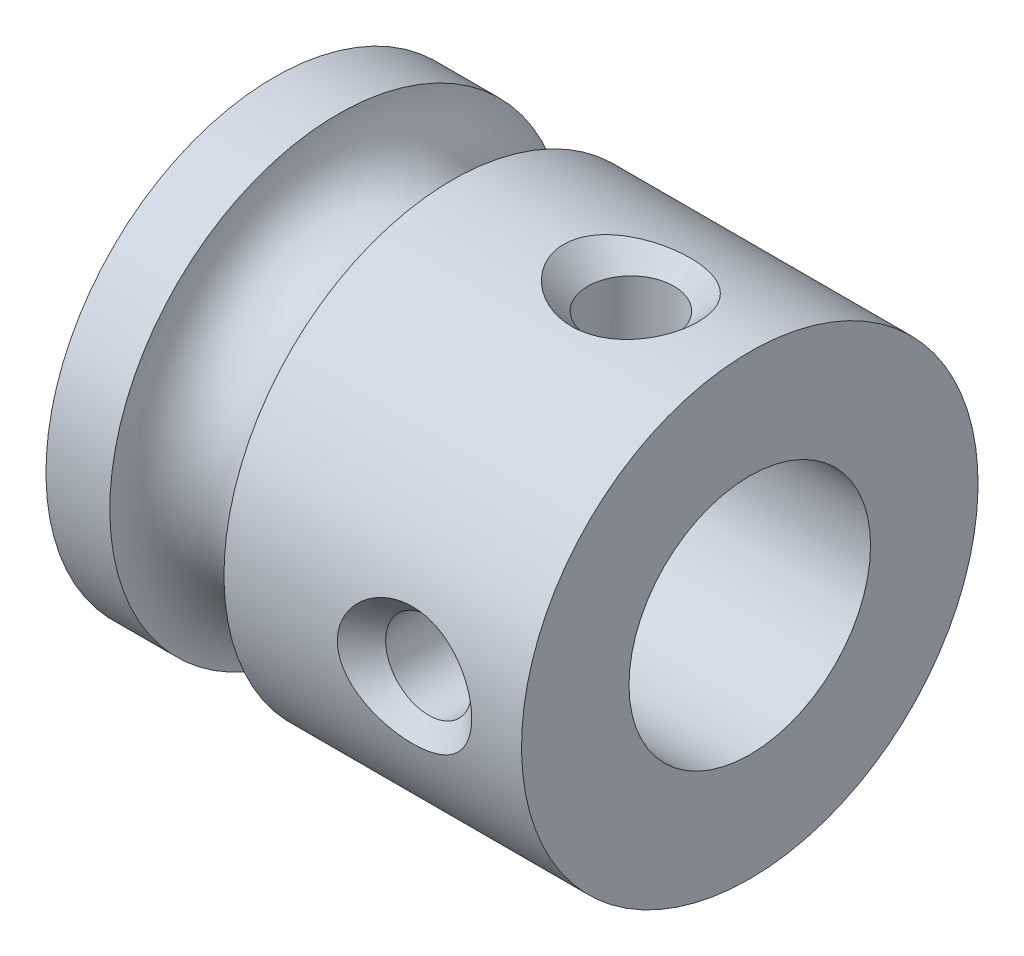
ISO-10303-21;
HEADER;
FILE_DESCRIPTION(('STEP AP214'),'2;1');
FILE_NAME('part.step','',(''),(''),'','','');
FILE_SCHEMA(('AUTOMOTIVE_DESIGN { 1 0 10303 214 1 1 1 1 }'));
ENDSEC;
DATA;
#1=APPLICATION_CONTEXT('core data for automotive mechanical design processes');
#2=APPLICATION_PROTOCOL_DEFINITION('international standard','automotive_design',2000,#1);
#3=PRODUCT_CONTEXT('',#1,'mechanical');
#4=PRODUCT('Part','Part','',(#3));
#5=PRODUCT_RELATED_PRODUCT_CATEGORY('part','',(#4));
#6=PRODUCT_DEFINITION_FORMATION('','',#4);
#7=PRODUCT_DEFINITION_CONTEXT('part definition',#1,'design');
#8=PRODUCT_DEFINITION('design','',#6,#7);
#9=PRODUCT_DEFINITION_SHAPE('','',#8);
#10=(LENGTH_UNIT() NAMED_UNIT(*) SI_UNIT(.MILLI.,.METRE.));
#11=(NAMED_UNIT(*) PLANE_ANGLE_UNIT() SI_UNIT($,.RADIAN.));
#12=(NAMED_UNIT(*) SI_UNIT($,.STERADIAN.) SOLID_ANGLE_UNIT());
#13=UNCERTAINTY_MEASURE_WITH_UNIT(LENGTH_MEASURE(1.E-05),#10,'distance_accuracy_value','');
#14=(GEOMETRIC_REPRESENTATION_CONTEXT(3) GLOBAL_UNCERTAINTY_ASSIGNED_CONTEXT((#13)) GLOBAL_UNIT_ASSIGNED_CONTEXT((#10,
#11,#12)) REPRESENTATION_CONTEXT('',''));
#15=CARTESIAN_POINT('',(0.,0.,0.));
#16=DIRECTION('',(0.,0.,1.));
#17=DIRECTION('',(1.,0.,0.));
#18=AXIS2_PLACEMENT_3D('',#15,#16,#17);
#19=CARTESIAN_POINT('',(-6.25,6.,0.));
#20=DIRECTION('',(1.,0.,0.));
#21=DIRECTION('',(0.,1.,0.));
#22=AXIS2_PLACEMENT_3D('',#19,#20,#21);
#23=PLANE('',#22);
#24=CARTESIAN_POINT('',(-6.25,0.,0.));
#25=DIRECTION('',(1.,0.,0.));
#26=DIRECTION('',(0.,0.,-1.));
#27=AXIS2_PLACEMENT_3D('',#24,#25,#26);
#28=CIRCLE('',#27,3.175);
#29=CARTESIAN_POINT('',(-6.25,0.,-3.175));
#30=VERTEX_POINT('',#29);
#31=EDGE_CURVE('E105',#30,#30,#28,.T.);
#32=ORIENTED_EDGE('',*,*,#31,.T.);
#33=EDGE_LOOP('',(#32));
#34=FACE_BOUND('',#33,.T.);
#35=CARTESIAN_POINT('',(-6.25,0.,0.));
#36=DIRECTION('',(-1.,0.,0.));
#37=DIRECTION('',(0.,-1.,0.));
#38=AXIS2_PLACEMENT_3D('',#35,#36,#37);
#39=CIRCLE('',#38,5.99999999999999);
#40=CARTESIAN_POINT('',(-6.25,-5.99999999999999,0.));
#41=VERTEX_POINT('',#40);
#42=EDGE_CURVE('E108',#41,#41,#39,.T.);
#43=ORIENTED_EDGE('',*,*,#42,.T.);
#44=EDGE_LOOP('',(#43));
#45=FACE_BOUND('',#44,.T.);
#46=ADVANCED_FACE('F35',(#34,#45),#23,.F.);
#47=CARTESIAN_POINT('',(6.25,6.,0.));
#48=DIRECTION('',(-1.,0.,0.));
#49=DIRECTION('',(0.,-1.,0.));
#50=AXIS2_PLACEMENT_3D('',#47,#48,#49);
#51=PLANE('',#50);
#52=CARTESIAN_POINT('',(6.25,0.,0.));
#53=DIRECTION('',(1.,0.,0.));
#54=DIRECTION('',(0.,0.,-1.));
#55=AXIS2_PLACEMENT_3D('',#52,#53,#54);
#56=CIRCLE('',#55,3.175);
#57=CARTESIAN_POINT('',(6.25,0.,-3.175));
#58=VERTEX_POINT('',#57);
#59=EDGE_CURVE('E113',#58,#58,#56,.T.);
#60=ORIENTED_EDGE('',*,*,#59,.F.);
#61=EDGE_LOOP('',(#60));
#62=FACE_BOUND('',#61,.T.);
#63=CARTESIAN_POINT('',(6.25,0.,0.));
#64=DIRECTION('',(-1.,0.,0.));
#65=DIRECTION('',(0.,-1.,0.));
#66=AXIS2_PLACEMENT_3D('',#63,#64,#65);
#67=CIRCLE('',#66,5.99999999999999);
#68=CARTESIAN_POINT('',(6.25,-5.99999999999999,0.));
#69=VERTEX_POINT('',#68);
#70=EDGE_CURVE('E49',#69,#69,#67,.T.);
#71=ORIENTED_EDGE('',*,*,#70,.F.);
#72=EDGE_LOOP('',(#71));
#73=FACE_BOUND('',#72,.T.);
#74=ADVANCED_FACE('F93',(#62,#73),#51,.F.);
#75=CARTESIAN_POINT('',(-27.9821883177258,0.,0.));
#76=DIRECTION('',(-1.,0.,0.));
#77=DIRECTION('',(0.,-1.,0.));
#78=AXIS2_PLACEMENT_3D('',#75,#76,#77);
#79=CYLINDRICAL_SURFACE('',#78,5.99999999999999);
#80=CARTESIAN_POINT('',(1.98582900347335,-1.1497584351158,5.88880765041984));
#81=CARTESIAN_POINT('',(1.92256396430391,-1.09867562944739,5.89878047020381));
#82=CARTESIAN_POINT('',(1.86295150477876,-1.0431284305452,5.90893808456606));
#83=CARTESIAN_POINT('',(1.75259962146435,-0.923689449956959,5.92878244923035));
#84=CARTESIAN_POINT('',(1.70186117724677,-0.859796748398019,5.93846914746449));
#85=CARTESIAN_POINT('',(1.60475637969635,-0.715263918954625,5.95771798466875));
#86=CARTESIAN_POINT('',(1.55995563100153,-0.63352922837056,5.9670790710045));
#87=CARTESIAN_POINT('',(1.48677574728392,-0.462716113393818,5.98274294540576));
#88=CARTESIAN_POINT('',(1.45838486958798,-0.373642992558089,5.98904791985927));
#89=CARTESIAN_POINT('',(1.42244978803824,-0.202993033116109,5.99709496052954));
#90=CARTESIAN_POINT('',(1.41271975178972,-0.121896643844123,5.99931400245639));
#91=CARTESIAN_POINT('',(1.40788784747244,0.0407329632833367,6.00041151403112));
#92=CARTESIAN_POINT('',(1.41277817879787,0.122265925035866,5.99929176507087));
#93=CARTESIAN_POINT('',(1.43593853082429,0.27691734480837,5.99406837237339));
#94=CARTESIAN_POINT('',(1.45316296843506,0.350204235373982,5.99019807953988));
#95=CARTESIAN_POINT('',(1.49894636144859,0.492961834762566,5.98014322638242));
#96=CARTESIAN_POINT('',(1.52750675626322,0.562432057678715,5.97395837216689));
#97=CARTESIAN_POINT('',(1.59615155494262,0.698882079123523,5.959569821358));
#98=CARTESIAN_POINT('',(1.63666976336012,0.765634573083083,5.95129221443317));
#99=CARTESIAN_POINT('',(1.72713995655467,0.892224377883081,5.93363537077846));
#100=CARTESIAN_POINT('',(1.77709576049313,0.952058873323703,5.92425568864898));
#101=CARTESIAN_POINT('',(1.89135797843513,1.07069918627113,5.90403651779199));
#102=CARTESIAN_POINT('',(1.95666495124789,1.12853365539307,5.89315621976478));
#103=CARTESIAN_POINT('',(2.0952376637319,1.23384485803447,5.87201134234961));
#104=CARTESIAN_POINT('',(2.16850745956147,1.28131627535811,5.86174708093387));
#105=CARTESIAN_POINT('',(2.33069428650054,1.37062173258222,5.841553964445));
#106=CARTESIAN_POINT('',(2.4204250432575,1.41102726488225,5.83182444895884));
#107=CARTESIAN_POINT('',(2.60527456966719,1.47761118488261,5.81531116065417));
#108=CARTESIAN_POINT('',(2.70039510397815,1.50378488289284,5.80852835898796));
#109=CARTESIAN_POINT('',(2.90049340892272,1.54287980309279,5.79827299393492));
#110=CARTESIAN_POINT('',(3.00569393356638,1.55473946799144,5.79506680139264));
#111=CARTESIAN_POINT('',(3.21668421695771,1.56155017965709,5.79323500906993));
#112=CARTESIAN_POINT('',(3.32247405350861,1.55649893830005,5.79461002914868));
#113=CARTESIAN_POINT('',(3.53353764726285,1.52933750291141,5.80183828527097));
#114=CARTESIAN_POINT('',(3.63877167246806,1.50693718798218,5.80776766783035));
#115=CARTESIAN_POINT('',(3.8438356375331,1.44507823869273,5.82346635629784));
#116=CARTESIAN_POINT('',(3.94366453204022,1.40561631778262,5.83323640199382));
#117=CARTESIAN_POINT('',(4.13397781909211,1.31064901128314,5.85530084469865));
#118=CARTESIAN_POINT('',(4.22453769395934,1.25529003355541,5.86757192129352));
#119=CARTESIAN_POINT('',(4.39415074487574,1.12919274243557,5.89313562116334));
#120=CARTESIAN_POINT('',(4.47320565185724,1.0584567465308,5.90642809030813));
#121=CARTESIAN_POINT('',(4.61175384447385,0.907818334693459,5.93138370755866));
#122=CARTESIAN_POINT('',(4.67216546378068,0.828773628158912,5.94309674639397));
#123=CARTESIAN_POINT('',(4.7765263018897,0.660195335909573,5.96416874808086));
#124=CARTESIAN_POINT('',(4.82049800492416,0.57067629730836,5.97353092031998));
#125=CARTESIAN_POINT('',(4.88438443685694,0.396718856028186,5.98741815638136));
#126=CARTESIAN_POINT('',(4.90673817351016,0.313214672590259,5.99242422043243));
#127=CARTESIAN_POINT('',(4.93544905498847,0.143381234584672,5.9988859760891));
#128=CARTESIAN_POINT('',(4.94182008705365,0.057054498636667,6.00034474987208));
#129=CARTESIAN_POINT('',(4.93836942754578,-0.105352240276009,5.99956185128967));
#130=CARTESIAN_POINT('',(4.93031154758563,-0.181478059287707,5.99772321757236));
#131=CARTESIAN_POINT('',(4.9017862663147,-0.33123434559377,5.9913186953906));
#132=CARTESIAN_POINT('',(4.88131920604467,-0.404864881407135,5.98675288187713));
#133=CARTESIAN_POINT('',(4.82903124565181,-0.547637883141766,5.97538482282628));
#134=CARTESIAN_POINT('',(4.79722606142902,-0.616786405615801,5.96858567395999));
#135=CARTESIAN_POINT('',(4.7235976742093,-0.749314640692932,5.95340107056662));
#136=CARTESIAN_POINT('',(4.68177142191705,-0.81269258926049,5.94501513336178));
#137=CARTESIAN_POINT('',(4.58498364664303,-0.938599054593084,5.92650599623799));
#138=CARTESIAN_POINT('',(4.52913471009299,-1.00043063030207,5.91629304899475));
#139=CARTESIAN_POINT('',(4.40888796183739,-1.1150961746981,5.89575784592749));
#140=CARTESIAN_POINT('',(4.34448581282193,-1.16792554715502,5.8854355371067));
#141=CARTESIAN_POINT('',(4.19992005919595,-1.27030383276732,5.86424872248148));
#142=CARTESIAN_POINT('',(4.11879660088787,-1.31852122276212,5.85348972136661));
#143=CARTESIAN_POINT('',(3.94997245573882,-1.40215417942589,5.83402179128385));
#144=CARTESIAN_POINT('',(3.86226900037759,-1.43756432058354,5.82531373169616));
#145=CARTESIAN_POINT('',(3.67390722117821,-1.49787467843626,5.81011525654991));
#146=CARTESIAN_POINT('',(3.57280642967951,-1.52147241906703,5.80391061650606));
#147=CARTESIAN_POINT('',(3.36798630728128,-1.5524746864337,5.79569494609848));
#148=CARTESIAN_POINT('',(3.26426655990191,-1.5598766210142,5.79368458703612));
#149=CARTESIAN_POINT('',(3.05352667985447,-1.558341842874,5.7940983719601));
#150=CARTESIAN_POINT('',(2.94651032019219,-1.54885915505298,5.79667070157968));
#151=CARTESIAN_POINT('',(2.73560331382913,-1.51263425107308,5.80622799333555));
#152=CARTESIAN_POINT('',(2.63171362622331,-1.48588679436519,5.81321429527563));
#153=CARTESIAN_POINT('',(2.43216802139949,-1.41627594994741,5.83055881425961));
#154=CARTESIAN_POINT('',(2.33638744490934,-1.37375213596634,5.84084540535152));
#155=CARTESIAN_POINT('',(2.15369382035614,-1.27316382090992,5.86359118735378));
#156=CARTESIAN_POINT('',(2.06677190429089,-1.2151150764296,5.87604817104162));
#157=CARTESIAN_POINT('',(1.98582900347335,-1.1497584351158,5.88880765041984));
#158=B_SPLINE_CURVE_WITH_KNOTS('',3,(#80,#81,#82,#83,#84,#85,#86,#87,#88,#89,#90,#91,#92,#93,
#94,#95,#96,#97,#98,#99,#100,#101,#102,#103,#104,#105,#106,#107,#108,#109,#110,#111,#112,#113,
#114,#115,#116,#117,#118,#119,#120,#121,#122,#123,#124,#125,#126,#127,#128,#129,#130,#131,#132,
#133,#134,#135,#136,#137,#138,#139,#140,#141,#142,#143,#144,#145,#146,#147,#148,#149,#150,#151,
#152,#153,#154,#155,#156,#157),.UNSPECIFIED.,.T.,.F.,(4,2,2,2,2,2,2,2,2,2,2,2,2,2,2,2,2,2,2,2,2,
2,2,2,2,2,2,2,2,2,2,2,2,2,2,2,2,2,4),(0.,0.245511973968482,0.49105103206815,0.7704209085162,
1.04959062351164,1.29338310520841,1.53704553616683,1.76218133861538,1.98734573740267,
2.22197140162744,2.45669221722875,2.71936969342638,2.98218160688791,3.27757543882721,
3.57306655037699,3.8893403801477,4.20565700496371,4.52738058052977,4.84916615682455,
5.16807832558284,5.48694246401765,5.78572744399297,6.08410227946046,6.34237487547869,
6.60042298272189,6.82904241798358,7.05765557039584,7.28595306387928,7.51432011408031,
7.76515327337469,8.01611411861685,8.29988009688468,8.58376614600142,8.89436491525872,
9.2050133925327,9.52588998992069,9.84686403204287,10.1612962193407,10.475410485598),.UNSPECIFIED.);
#159=CARTESIAN_POINT('',(1.98582900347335,-1.1497584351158,5.88880765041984));
#160=VERTEX_POINT('',#159);
#161=EDGE_CURVE('E10',#160,#160,#158,.T.);
#162=ORIENTED_EDGE('',*,*,#161,.T.);
#163=EDGE_LOOP('',(#162));
#164=FACE_BOUND('',#163,.T.);
#165=CARTESIAN_POINT('',(1.93582900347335,5.88880765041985,-1.1497584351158));
#166=CARTESIAN_POINT('',(2.01449710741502,5.87640691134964,-1.21327658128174));
#167=CARTESIAN_POINT('',(2.09885933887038,5.86428443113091,-1.2699258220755));
#168=CARTESIAN_POINT('',(2.27608287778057,5.84204435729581,-1.36860906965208));
#169=CARTESIAN_POINT('',(2.3689596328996,5.83193051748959,-1.41061582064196));
#170=CARTESIAN_POINT('',(2.56089156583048,5.81483480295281,-1.47951525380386));
#171=CARTESIAN_POINT('',(2.65997176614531,5.80786668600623,-1.50634167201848));
#172=CARTESIAN_POINT('',(2.86124327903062,5.79791733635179,-1.54419553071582));
#173=CARTESIAN_POINT('',(2.96343328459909,5.79493445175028,-1.55522951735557));
#174=CARTESIAN_POINT('',(3.17275700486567,5.7932533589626,-1.56148410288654));
#175=CARTESIAN_POINT('',(3.27991397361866,5.79474535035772,-1.556002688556));
#176=CARTESIAN_POINT('',(3.49179652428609,5.80225095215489,-1.52777369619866));
#177=CARTESIAN_POINT('',(3.59652141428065,5.80826583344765,-1.50502126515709));
#178=CARTESIAN_POINT('',(3.80081055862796,5.82410279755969,-1.44252008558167));
#179=CARTESIAN_POINT('',(3.90035929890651,5.83393565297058,-1.402723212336));
#180=CARTESIAN_POINT('',(4.09093801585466,5.85619016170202,-1.30669710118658));
#181=CARTESIAN_POINT('',(4.18196678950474,5.86861217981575,-1.25046554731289));
#182=CARTESIAN_POINT('',(4.34966892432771,5.89405194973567,-1.12434747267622));
#183=CARTESIAN_POINT('',(4.42669091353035,5.90704066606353,-1.0549210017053));
#184=CARTESIAN_POINT('',(4.56628250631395,5.9322150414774,-0.902634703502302));
#185=CARTESIAN_POINT('',(4.62886385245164,5.94440134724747,-0.819785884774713));
#186=CARTESIAN_POINT('',(4.73039719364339,5.96500092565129,-0.652024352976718));
#187=CARTESIAN_POINT('',(4.77113297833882,5.97367516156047,-0.568228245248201));
#188=CARTESIAN_POINT('',(4.83560276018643,5.98767698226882,-0.394089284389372));
#189=CARTESIAN_POINT('',(4.85935987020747,5.99300911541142,-0.303755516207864));
#190=CARTESIAN_POINT('',(4.88615692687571,5.99905072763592,-0.1328904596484));
#191=CARTESIAN_POINT('',(4.89162849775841,6.00030216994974,-0.0527539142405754));
#192=CARTESIAN_POINT('',(4.88842792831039,5.99957426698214,0.107210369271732));
#193=CARTESIAN_POINT('',(4.87976044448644,5.99759598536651,0.187038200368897));
#194=CARTESIAN_POINT('',(4.84976821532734,5.99086921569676,0.339006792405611));
#195=CARTESIAN_POINT('',(4.82925391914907,5.98629841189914,0.411318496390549));
#196=CARTESIAN_POINT('',(4.77723199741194,5.97499946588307,0.551673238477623));
#197=CARTESIAN_POINT('',(4.74572267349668,5.96827099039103,0.619715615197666));
#198=CARTESIAN_POINT('',(4.6709287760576,5.95285567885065,0.753875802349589));
#199=CARTESIAN_POINT('',(4.62707837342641,5.94407951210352,0.81966636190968));
#200=CARTESIAN_POINT('',(4.53014328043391,5.92562440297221,0.943889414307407));
#201=CARTESIAN_POINT('',(4.47705454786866,5.91594506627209,1.00231866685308));
#202=CARTESIAN_POINT('',(4.35610496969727,5.89527457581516,1.11785555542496));
#203=CARTESIAN_POINT('',(4.28722828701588,5.88426985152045,1.1738970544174));
#204=CARTESIAN_POINT('',(4.14177131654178,5.86317502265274,1.27509027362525));
#205=CARTESIAN_POINT('',(4.0651871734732,5.85308538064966,1.32023650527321));
#206=CARTESIAN_POINT('',(3.89668085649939,5.83362914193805,1.40386500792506));
#207=CARTESIAN_POINT('',(3.804018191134,5.82449171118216,1.44091359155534));
#208=CARTESIAN_POINT('',(3.61383750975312,5.80948253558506,1.50028399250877));
#209=CARTESIAN_POINT('',(3.51631808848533,5.80361174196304,1.52260152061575));
#210=CARTESIAN_POINT('',(3.31279412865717,5.79552878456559,1.55310020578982));
#211=CARTESIAN_POINT('',(3.20663594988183,5.79356301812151,1.56033069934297));
#212=CARTESIAN_POINT('',(2.99453981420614,5.7942660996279,1.55771618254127));
#213=CARTESIAN_POINT('',(2.8886018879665,5.79693555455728,1.54786893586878));
#214=CARTESIAN_POINT('',(2.67857429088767,5.80664761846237,1.51102915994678));
#215=CARTESIAN_POINT('',(2.57452435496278,5.81374455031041,1.4838235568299));
#216=CARTESIAN_POINT('',(2.3726748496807,5.83148585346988,1.41248596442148));
#217=CARTESIAN_POINT('',(2.27487653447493,5.84213093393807,1.36835059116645));
#218=CARTESIAN_POINT('',(2.08990643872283,5.86547592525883,1.26450761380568));
#219=CARTESIAN_POINT('',(2.00260967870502,5.87814634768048,1.20501690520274));
#220=CARTESIAN_POINT('',(1.84036502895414,5.90401688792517,1.07108271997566));
#221=CARTESIAN_POINT('',(1.76541337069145,5.91721684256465,0.99664382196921));
#222=CARTESIAN_POINT('',(1.63643045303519,5.94134715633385,0.840336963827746));
#223=CARTESIAN_POINT('',(1.58126009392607,5.95237322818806,0.759429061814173));
#224=CARTESIAN_POINT('',(1.48770758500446,5.97172201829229,0.588143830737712));
#225=CARTESIAN_POINT('',(1.44930140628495,5.98004860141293,0.497780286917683));
#226=CARTESIAN_POINT('',(1.39595189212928,5.99179936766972,0.323817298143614));
#227=CARTESIAN_POINT('',(1.3784890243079,5.99574415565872,0.241023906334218));
#228=CARTESIAN_POINT('',(1.35909484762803,6.00013162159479,0.0735621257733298));
#229=CARTESIAN_POINT('',(1.35715207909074,6.00057688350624,-0.0111048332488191));
#230=CARTESIAN_POINT('',(1.3682962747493,5.99804910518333,-0.170672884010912));
#231=CARTESIAN_POINT('',(1.37987317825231,5.99541947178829,-0.245690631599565));
#232=CARTESIAN_POINT('',(1.41500731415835,5.98758623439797,-0.392724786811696));
#233=CARTESIAN_POINT('',(1.43856702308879,5.9823820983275,-0.464740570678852));
#234=CARTESIAN_POINT('',(1.49701267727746,5.96983089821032,-0.605122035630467));
#235=CARTESIAN_POINT('',(1.532071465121,5.96245131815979,-0.673412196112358));
#236=CARTESIAN_POINT('',(1.61196643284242,5.9462838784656,-0.80375604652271));
#237=CARTESIAN_POINT('',(1.65679828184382,5.93749664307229,-0.865812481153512));
#238=CARTESIAN_POINT('',(1.74030838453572,5.92194720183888,-0.965551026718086));
#239=CARTESIAN_POINT('',(1.77690804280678,5.91535114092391,-1.00502767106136));
#240=CARTESIAN_POINT('',(1.85374434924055,5.90207969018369,-1.08023695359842));
#241=CARTESIAN_POINT('',(1.8939810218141,5.89540429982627,-1.11596956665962));
#242=CARTESIAN_POINT('',(1.93582900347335,5.88880765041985,-1.1497584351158));
#243=B_SPLINE_CURVE_WITH_KNOTS('',3,(#165,#166,#167,#168,#169,#170,#171,#172,#173,#174,#175,
#176,#177,#178,#179,#180,#181,#182,#183,#184,#185,#186,#187,#188,#189,#190,#191,#192,#193,#194,
#195,#196,#197,#198,#199,#200,#201,#202,#203,#204,#205,#206,#207,#208,#209,#210,#211,#212,#213,
#214,#215,#216,#217,#218,#219,#220,#221,#222,#223,#224,#225,#226,#227,#228,#229,#230,#231,#232,
#233,#234,#235,#236,#237,#238,#239,#240,#241,#242),.UNSPECIFIED.,.T.,.F.,(4,2,2,2,2,2,2,2,2,2,2,
2,2,2,2,2,2,2,2,2,2,2,2,2,2,2,2,2,2,2,2,2,2,2,2,2,2,2,4),(0.,0.305401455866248,
0.611368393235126,0.918660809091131,1.22582581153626,1.54622888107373,1.86672201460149,
2.188126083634,2.50957546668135,2.82138528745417,3.13294065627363,3.4119996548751,
3.69067804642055,3.93040363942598,4.17005029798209,4.39497187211,4.61992820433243,
4.85762506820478,5.09542619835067,5.36277249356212,5.63025318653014,5.92958497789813,
6.22900388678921,6.54678146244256,6.86460065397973,7.18639816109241,7.50826002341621,
7.82580312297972,8.14324910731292,8.43715799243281,8.73064420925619,8.98333026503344,
9.23582972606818,9.46262185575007,9.68946087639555,9.91987901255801,10.1501952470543,
10.3126543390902,10.4751145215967),.UNSPECIFIED.);
#244=CARTESIAN_POINT('',(1.93582900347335,5.88880765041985,-1.1497584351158));
#245=VERTEX_POINT('',#244);
#246=EDGE_CURVE('E45',#245,#245,#243,.T.);
#247=ORIENTED_EDGE('',*,*,#246,.T.);
#248=EDGE_LOOP('',(#247));
#249=FACE_BOUND('',#248,.T.);
#250=CARTESIAN_POINT('',(-1.57146093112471,0.,0.));
#251=DIRECTION('',(-1.,0.,0.));
#252=DIRECTION('',(0.,-1.,0.));
#253=AXIS2_PLACEMENT_3D('',#250,#251,#252);
#254=CIRCLE('',#253,5.99999999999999);
#255=CARTESIAN_POINT('',(-1.5714609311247,-5.99999999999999,0.));
#256=VERTEX_POINT('',#255);
#257=EDGE_CURVE('E54',#256,#256,#254,.T.);
#258=ORIENTED_EDGE('',*,*,#257,.F.);
#259=EDGE_LOOP('',(#258));
#260=FACE_BOUND('',#259,.T.);
#261=ORIENTED_EDGE('',*,*,#70,.T.);
#262=EDGE_LOOP('',(#261));
#263=FACE_BOUND('',#262,.T.);
#264=ADVANCED_FACE('F69',(#164,#249,#260,#263),#79,.T.);
#265=CARTESIAN_POINT('',(-3.0714609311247,0.,0.));
#266=DIRECTION('',(-1.,0.,0.));
#267=DIRECTION('',(0.,-1.,0.));
#268=AXIS2_PLACEMENT_3D('',#265,#266,#267);
#269=TOROIDAL_SURFACE('',#268,5.99999999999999,1.5);
#270=CARTESIAN_POINT('',(-4.5714609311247,0.,0.));
#271=DIRECTION('',(-1.,0.,0.));
#272=DIRECTION('',(0.,-1.,0.));
#273=AXIS2_PLACEMENT_3D('',#270,#271,#272);
#274=CIRCLE('',#273,5.99999999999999);
#275=CARTESIAN_POINT('',(-4.5714609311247,-5.99999999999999,0.));
#276=VERTEX_POINT('',#275);
#277=EDGE_CURVE('E109',#276,#276,#274,.T.);
#278=ORIENTED_EDGE('',*,*,#277,.F.);
#279=EDGE_LOOP('',(#278));
#280=FACE_BOUND('',#279,.T.);
#281=ORIENTED_EDGE('',*,*,#257,.T.);
#282=EDGE_LOOP('',(#281));
#283=FACE_BOUND('',#282,.T.);
#284=ADVANCED_FACE('F86',(#280,#283),#269,.F.);
#285=CARTESIAN_POINT('',(-27.9821883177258,0.,0.));
#286=DIRECTION('',(-1.,0.,0.));
#287=DIRECTION('',(0.,-1.,0.));
#288=AXIS2_PLACEMENT_3D('',#285,#286,#287);
#289=CYLINDRICAL_SURFACE('',#288,5.99999999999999);
#290=ORIENTED_EDGE('',*,*,#42,.F.);
#291=EDGE_LOOP('',(#290));
#292=FACE_BOUND('',#291,.T.);
#293=ORIENTED_EDGE('',*,*,#277,.T.);
#294=EDGE_LOOP('',(#293));
#295=FACE_BOUND('',#294,.T.);
#296=ADVANCED_FACE('F82',(#292,#295),#289,.T.);
#297=CARTESIAN_POINT('',(6.25,0.,0.));
#298=DIRECTION('',(1.,0.,0.));
#299=DIRECTION('',(0.,0.,-1.));
#300=AXIS2_PLACEMENT_3D('',#297,#298,#299);
#301=CYLINDRICAL_SURFACE('',#300,3.175);
#302=CARTESIAN_POINT('',(2.04470000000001,0.,3.175));
#303=CARTESIAN_POINT('',(2.04469877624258,-0.0614285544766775,3.17500087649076));
#304=CARTESIAN_POINT('',(2.04972367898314,-0.122848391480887,3.17320130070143));
#305=CARTESIAN_POINT('',(2.06961858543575,-0.243864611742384,3.16620100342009));
#306=CARTESIAN_POINT('',(2.08448828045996,-0.303461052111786,3.16100038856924));
#307=CARTESIAN_POINT('',(2.12348844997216,-0.419068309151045,3.14775949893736));
#308=CARTESIAN_POINT('',(2.14760216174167,-0.475085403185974,3.13972436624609));
#309=CARTESIAN_POINT('',(2.20432504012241,-0.582278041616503,3.12162393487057));
#310=CARTESIAN_POINT('',(2.23693622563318,-0.63345243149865,3.11155815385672));
#311=CARTESIAN_POINT('',(2.31105507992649,-0.731495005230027,3.09000790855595));
#312=CARTESIAN_POINT('',(2.35283431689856,-0.778149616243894,3.07848610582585));
#313=CARTESIAN_POINT('',(2.44352654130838,-0.863958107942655,3.055516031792));
#314=CARTESIAN_POINT('',(2.49244140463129,-0.903110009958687,3.04406778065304));
#315=CARTESIAN_POINT('',(2.59802569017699,-0.974093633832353,3.02211785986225));
#316=CARTESIAN_POINT('',(2.65490051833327,-1.00563502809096,3.01166094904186));
#317=CARTESIAN_POINT('',(2.77357939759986,-1.05861134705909,2.99345244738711));
#318=CARTESIAN_POINT('',(2.8353816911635,-1.08004985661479,2.98569989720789));
#319=CARTESIAN_POINT('',(2.9597149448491,-1.11138819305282,2.9741742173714));
#320=CARTESIAN_POINT('',(3.0221306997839,-1.12169236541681,2.97026214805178));
#321=CARTESIAN_POINT('',(3.14791847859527,-1.13173392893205,2.96645158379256));
#322=CARTESIAN_POINT('',(3.21129014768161,-1.13147514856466,2.96655163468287));
#323=CARTESIAN_POINT('',(3.3336133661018,-1.12070953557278,2.97063328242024));
#324=CARTESIAN_POINT('',(3.39262097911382,-1.11074743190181,2.9744085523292));
#325=CARTESIAN_POINT('',(3.50806464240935,-1.08175290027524,2.98507483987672));
#326=CARTESIAN_POINT('',(3.56450034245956,-1.06271924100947,2.99196628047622));
#327=CARTESIAN_POINT('',(3.67436762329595,-1.01579639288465,3.00822311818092));
#328=CARTESIAN_POINT('',(3.72772847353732,-0.987756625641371,3.01763009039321));
#329=CARTESIAN_POINT('',(3.82915226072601,-0.923722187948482,3.03784253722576));
#330=CARTESIAN_POINT('',(3.87721349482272,-0.887724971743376,3.04864845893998));
#331=CARTESIAN_POINT('',(3.96971122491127,-0.806247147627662,3.0712342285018));
#332=CARTESIAN_POINT('',(4.01375635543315,-0.760326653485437,3.08303358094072));
#333=CARTESIAN_POINT('',(4.09363040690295,-0.661610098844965,3.10571393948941));
#334=CARTESIAN_POINT('',(4.12945830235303,-0.608813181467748,3.11659483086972));
#335=CARTESIAN_POINT('',(4.19225643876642,-0.496923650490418,3.13639217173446));
#336=CARTESIAN_POINT('',(4.21910836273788,-0.437759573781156,3.14528190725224));
#337=CARTESIAN_POINT('',(4.2623520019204,-0.315359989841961,3.15989936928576));
#338=CARTESIAN_POINT('',(4.27874788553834,-0.252126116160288,3.16562835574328));
#339=CARTESIAN_POINT('',(4.29988948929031,-0.126684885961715,3.17306329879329));
#340=CARTESIAN_POINT('',(4.3051630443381,-0.0645771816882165,3.17495136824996));
#341=CARTESIAN_POINT('',(4.30543160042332,0.0596565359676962,3.17504672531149));
#342=CARTESIAN_POINT('',(4.30042861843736,0.121782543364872,3.1732547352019));
#343=CARTESIAN_POINT('',(4.28069555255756,0.2420876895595,3.16631168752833));
#344=CARTESIAN_POINT('',(4.26630097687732,0.300329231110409,3.16127656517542));
#345=CARTESIAN_POINT('',(4.22862458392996,0.413538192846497,3.14846933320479));
#346=CARTESIAN_POINT('',(4.20534161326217,0.468505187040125,3.14069686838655));
#347=CARTESIAN_POINT('',(4.14983109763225,0.57533272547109,3.12292068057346));
#348=CARTESIAN_POINT('',(4.11737039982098,0.627062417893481,3.11286035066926));
#349=CARTESIAN_POINT('',(4.04469392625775,0.724505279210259,3.09163517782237));
#350=CARTESIAN_POINT('',(4.00447550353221,0.770216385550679,3.08046995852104));
#351=CARTESIAN_POINT('',(3.91495158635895,0.856811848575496,3.05754963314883));
#352=CARTESIAN_POINT('',(3.86528162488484,0.897320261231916,3.0457941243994));
#353=CARTESIAN_POINT('',(3.75960588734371,0.96948829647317,3.02359841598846));
#354=CARTESIAN_POINT('',(3.70359981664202,1.00114750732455,3.01315827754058));
#355=CARTESIAN_POINT('',(3.58660726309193,1.05465477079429,2.99485112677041));
#356=CARTESIAN_POINT('',(3.52561638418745,1.07649405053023,2.98698641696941));
#357=CARTESIAN_POINT('',(3.40047036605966,1.10946944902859,2.97489781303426));
#358=CARTESIAN_POINT('',(3.33631694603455,1.12061131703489,2.97067196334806));
#359=CARTESIAN_POINT('',(3.21069434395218,1.13139068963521,2.96658222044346));
#360=CARTESIAN_POINT('',(3.14928675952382,1.13166111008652,2.96647835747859));
#361=CARTESIAN_POINT('',(3.02735111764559,1.12228164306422,2.97003931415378));
#362=CARTESIAN_POINT('',(2.96682299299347,1.1126325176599,2.97370384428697));
#363=CARTESIAN_POINT('',(2.84987294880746,1.08416089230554,2.98419839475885));
#364=CARTESIAN_POINT('',(2.79338646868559,1.06557142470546,2.99094779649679));
#365=CARTESIAN_POINT('',(2.68429540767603,1.01994372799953,3.0068123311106));
#366=CARTESIAN_POINT('',(2.63169176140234,0.992903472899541,3.01592803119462));
#367=CARTESIAN_POINT('',(2.52909051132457,0.929616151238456,3.03604854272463));
#368=CARTESIAN_POINT('',(2.4793429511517,0.89298623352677,3.0471235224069));
#369=CARTESIAN_POINT('',(2.38649729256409,0.812177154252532,3.06964995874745));
#370=CARTESIAN_POINT('',(2.34340120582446,0.767995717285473,3.08110152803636));
#371=CARTESIAN_POINT('',(2.26303642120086,0.670861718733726,3.10373428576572));
#372=CARTESIAN_POINT('',(2.22613466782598,0.617595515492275,3.11487776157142));
#373=CARTESIAN_POINT('',(2.16183451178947,0.505234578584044,3.13506244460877));
#374=CARTESIAN_POINT('',(2.13443530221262,0.446140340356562,3.14410383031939));
#375=CARTESIAN_POINT('',(2.09006649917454,0.323645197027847,3.15906443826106));
#376=CARTESIAN_POINT('',(2.07311543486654,0.260236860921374,3.16497811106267));
#377=CARTESIAN_POINT('',(2.05043499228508,0.13121513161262,3.17294468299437));
#378=CARTESIAN_POINT('',(2.04470130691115,0.0656025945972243,3.17499906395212));
#379=CARTESIAN_POINT('',(2.04470000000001,0.,3.175));
#380=B_SPLINE_CURVE_WITH_KNOTS('',3,(#302,#303,#304,#305,#306,#307,#308,#309,#310,#311,#312,
#313,#314,#315,#316,#317,#318,#319,#320,#321,#322,#323,#324,#325,#326,#327,#328,#329,#330,#331,
#332,#333,#334,#335,#336,#337,#338,#339,#340,#341,#342,#343,#344,#345,#346,#347,#348,#349,#350,
#351,#352,#353,#354,#355,#356,#357,#358,#359,#360,#361,#362,#363,#364,#365,#366,#367,#368,#369,
#370,#371,#372,#373,#374,#375,#376,#377,#378,#379),.UNSPECIFIED.,.T.,.F.,(4,2,2,2,2,2,2,2,2,2,2,
2,2,2,2,2,2,2,2,2,2,2,2,2,2,2,2,2,2,2,2,2,2,2,2,2,2,2,4),(0.,0.184043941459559,
0.368082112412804,0.55178812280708,0.735537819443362,0.925722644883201,1.11595755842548,
1.31258758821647,1.50914779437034,1.69830149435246,1.88738663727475,2.0664345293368,
2.24550673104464,2.42774410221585,2.61003985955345,2.80329006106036,2.99656436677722,
3.19229416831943,3.38794589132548,3.57408187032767,3.76018131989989,3.93997181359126,
4.11978564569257,4.30465683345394,4.48959121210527,4.68416822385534,4.87875428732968,
5.07351384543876,5.26816867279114,5.45147357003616,5.63476438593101,5.81351722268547,
5.99231294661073,6.17977826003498,6.36730015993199,6.56359488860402,6.75987294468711,
6.95649809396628,7.15304773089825),.UNSPECIFIED.);
#381=CARTESIAN_POINT('',(2.04470000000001,0.,3.175));
#382=VERTEX_POINT('',#381);
#383=EDGE_CURVE('E65',#382,#382,#380,.T.);
#384=ORIENTED_EDGE('',*,*,#383,.T.);
#385=EDGE_LOOP('',(#384));
#386=FACE_BOUND('',#385,.T.);
#387=CARTESIAN_POINT('',(3.125,2.96699290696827,-1.13029999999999));
#388=CARTESIAN_POINT('',(3.06371104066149,2.96699180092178,-1.1303012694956));
#389=CARTESIAN_POINT('',(3.00243087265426,2.96891266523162,-1.12529831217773));
#390=CARTESIAN_POINT('',(2.8817032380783,2.976341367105,-1.10549852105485));
#391=CARTESIAN_POINT('',(2.82225587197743,2.9818494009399,-1.09070115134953));
#392=CARTESIAN_POINT('',(2.70696624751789,2.9957511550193,-1.05191211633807));
#393=CARTESIAN_POINT('',(2.65111641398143,3.00413855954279,-1.02794056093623));
#394=CARTESIAN_POINT('',(2.54421075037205,3.02284430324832,-0.971553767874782));
#395=CARTESIAN_POINT('',(2.49315619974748,3.03316315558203,-0.939136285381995));
#396=CARTESIAN_POINT('',(2.39500779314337,3.05508626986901,-0.865225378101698));
#397=CARTESIAN_POINT('',(2.34815910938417,3.06672572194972,-0.823416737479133));
#398=CARTESIAN_POINT('',(2.26196785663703,3.08968323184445,-0.732580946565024));
#399=CARTESIAN_POINT('',(2.22262669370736,3.1010012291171,-0.683552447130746));
#400=CARTESIAN_POINT('',(2.15141872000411,3.1224537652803,-0.577839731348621));
#401=CARTESIAN_POINT('',(2.11981389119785,3.13254217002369,-0.520968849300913));
#402=CARTESIAN_POINT('',(2.066719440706,3.14997980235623,-0.402295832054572));
#403=CARTESIAN_POINT('',(2.04522668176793,3.15732987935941,-0.340495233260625));
#404=CARTESIAN_POINT('',(2.01381290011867,3.16821317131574,-0.216291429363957));
#405=CARTESIAN_POINT('',(2.00347077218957,3.17188488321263,-0.154007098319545));
#406=CARTESIAN_POINT('',(1.99330739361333,3.17549223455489,-0.0284859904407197));
#407=CARTESIAN_POINT('',(1.99348305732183,3.17542896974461,0.034750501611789));
#408=CARTESIAN_POINT('',(2.00409474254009,3.17166431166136,0.157380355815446));
#409=CARTESIAN_POINT('',(2.01407222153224,3.16812551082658,0.216819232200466));
#410=CARTESIAN_POINT('',(2.04323912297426,3.1580163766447,0.333116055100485));
#411=CARTESIAN_POINT('',(2.06242918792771,3.15144583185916,0.389973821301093));
#412=CARTESIAN_POINT('',(2.10971458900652,3.13581701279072,0.500434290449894));
#413=CARTESIAN_POINT('',(2.13793071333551,3.12672523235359,0.55398035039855));
#414=CARTESIAN_POINT('',(2.20236408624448,3.10698647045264,0.655704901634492));
#415=CARTESIAN_POINT('',(2.23858376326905,3.09633901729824,0.70388175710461));
#416=CARTESIAN_POINT('',(2.3202538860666,3.07392952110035,0.796215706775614));
#417=CARTESIAN_POINT('',(2.36609295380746,3.06213831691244,0.840022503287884));
#418=CARTESIAN_POINT('',(2.46455262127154,3.03923485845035,0.919450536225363));
#419=CARTESIAN_POINT('',(2.51717459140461,3.02812274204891,0.95507011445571));
#420=CARTESIAN_POINT('',(2.62895927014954,3.00766281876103,1.01769271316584));
#421=CARTESIAN_POINT('',(2.68822387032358,2.99835093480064,1.04452651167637));
#422=CARTESIAN_POINT('',(2.81084794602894,2.98296002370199,1.08770687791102));
#423=CARTESIAN_POINT('',(2.87420539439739,2.97687940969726,1.10405859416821));
#424=CARTESIAN_POINT('',(2.99978496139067,2.96900658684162,1.12505332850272));
#425=CARTESIAN_POINT('',(3.06190238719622,2.96701300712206,1.13024679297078));
#426=CARTESIAN_POINT('',(3.1861397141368,2.96697312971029,1.13035235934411));
#427=CARTESIAN_POINT('',(3.24825961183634,2.9689259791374,1.12526668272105));
#428=CARTESIAN_POINT('',(3.36806963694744,2.97635611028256,1.10545550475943));
#429=CARTESIAN_POINT('',(3.42583689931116,2.98168526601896,1.0911347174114));
#430=CARTESIAN_POINT('',(3.53812956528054,2.99509779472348,1.05375787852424));
#431=CARTESIAN_POINT('',(3.59265434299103,3.00318169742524,1.03070014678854));
#432=CARTESIAN_POINT('',(3.69902870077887,3.0215413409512,0.975593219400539));
#433=CARTESIAN_POINT('',(3.75071831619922,3.03188377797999,0.943258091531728));
#434=CARTESIAN_POINT('',(3.84813515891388,3.0534751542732,0.870827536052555));
#435=CARTESIAN_POINT('',(3.89386038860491,3.0647243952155,0.83072951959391));
#436=CARTESIAN_POINT('',(3.98070682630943,3.0876248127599,0.741245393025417));
#437=CARTESIAN_POINT('',(4.02142589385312,3.09926313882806,0.691464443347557));
#438=CARTESIAN_POINT('',(4.09397025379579,3.12101743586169,0.585488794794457));
#439=CARTESIAN_POINT('',(4.12579570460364,3.13113343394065,0.529294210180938));
#440=CARTESIAN_POINT('',(4.17939303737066,3.14867455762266,0.412253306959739));
#441=CARTESIAN_POINT('',(4.20121652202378,3.15611345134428,0.351432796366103));
#442=CARTESIAN_POINT('',(4.23421657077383,3.16751726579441,0.226662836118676));
#443=CARTESIAN_POINT('',(4.24539758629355,3.17148363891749,0.162714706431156));
#444=CARTESIAN_POINT('',(4.25635162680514,3.17537085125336,0.037158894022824));
#445=CARTESIAN_POINT('',(4.25669853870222,3.17549520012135,-0.0243929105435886));
#446=CARTESIAN_POINT('',(4.24742232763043,3.1722011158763,-0.146637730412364));
#447=CARTESIAN_POINT('',(4.23780021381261,3.16878304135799,-0.207330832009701));
#448=CARTESIAN_POINT('',(4.20925332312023,3.1588730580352,-0.324899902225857));
#449=CARTESIAN_POINT('',(4.19052049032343,3.15244466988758,-0.381828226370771));
#450=CARTESIAN_POINT('',(4.14446825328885,3.13717898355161,-0.491747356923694));
#451=CARTESIAN_POINT('',(4.11714724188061,3.12834123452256,-0.54473742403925));
#452=CARTESIAN_POINT('',(4.05344643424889,3.10871467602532,-0.647587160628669));
#453=CARTESIAN_POINT('',(4.01674861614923,3.09786207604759,-0.697237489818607));
#454=CARTESIAN_POINT('',(3.93585525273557,3.07555250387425,-0.789857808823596));
#455=CARTESIAN_POINT('',(3.89165715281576,3.06409532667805,-0.832825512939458));
#456=CARTESIAN_POINT('',(3.79457728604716,3.04122635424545,-0.912898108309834));
#457=CARTESIAN_POINT('',(3.74138813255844,3.0298412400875,-0.949639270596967));
#458=CARTESIAN_POINT('',(3.62922984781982,3.00903053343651,-1.01365584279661));
#459=CARTESIAN_POINT('',(3.57026116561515,2.99960478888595,-1.04093198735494));
#460=CARTESIAN_POINT('',(3.44802364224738,2.9839099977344,-1.08510912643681));
#461=CARTESIAN_POINT('',(3.38474775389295,2.97764627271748,-1.10199264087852));
#462=CARTESIAN_POINT('',(3.25597715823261,2.96918932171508,-1.12458464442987));
#463=CARTESIAN_POINT('',(3.19048356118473,2.96699408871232,-1.13029864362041));
#464=CARTESIAN_POINT('',(3.125,2.96699290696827,-1.13029999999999));
#465=B_SPLINE_CURVE_WITH_KNOTS('',3,(#387,#388,#389,#390,#391,#392,#393,#394,#395,#396,#397,
#398,#399,#400,#401,#402,#403,#404,#405,#406,#407,#408,#409,#410,#411,#412,#413,#414,#415,#416,
#417,#418,#419,#420,#421,#422,#423,#424,#425,#426,#427,#428,#429,#430,#431,#432,#433,#434,#435,
#436,#437,#438,#439,#440,#441,#442,#443,#444,#445,#446,#447,#448,#449,#450,#451,#452,#453,#454,
#455,#456,#457,#458,#459,#460,#461,#462,#463,#464),.UNSPECIFIED.,.T.,.F.,(4,2,2,2,2,2,2,2,2,2,2,
2,2,2,2,2,2,2,2,2,2,2,2,2,2,2,2,2,2,2,2,2,2,2,2,2,2,2,4),(0.,0.183623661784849,
0.367257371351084,0.550490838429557,0.73377305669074,0.924501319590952,1.11526526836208,
1.31179756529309,1.50826884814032,1.69702812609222,1.88573202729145,2.06600906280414,
2.24629867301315,2.42910965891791,2.61197618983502,2.80457310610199,2.99720899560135,
3.19336255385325,3.38941969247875,3.57555921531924,3.76165851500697,3.94011049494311,
4.11859681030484,4.30331748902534,4.48809987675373,4.68324756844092,4.87839178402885,
5.07251754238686,5.26656206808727,5.45030949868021,5.63403833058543,5.81405386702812,
5.9941031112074,6.18133819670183,6.36863718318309,6.56461137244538,6.76057034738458,
6.95685802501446,7.15304884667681),.UNSPECIFIED.);
#466=CARTESIAN_POINT('',(3.125,2.96699290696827,-1.13029999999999));
#467=VERTEX_POINT('',#466);
#468=EDGE_CURVE('E60',#467,#467,#465,.T.);
#469=ORIENTED_EDGE('',*,*,#468,.T.);
#470=EDGE_LOOP('',(#469));
#471=FACE_BOUND('',#470,.T.);
#472=ORIENTED_EDGE('',*,*,#31,.F.);
#473=EDGE_LOOP('',(#472));
#474=FACE_BOUND('',#473,.T.);
#475=ORIENTED_EDGE('',*,*,#59,.T.);
#476=EDGE_LOOP('',(#475));
#477=FACE_BOUND('',#476,.T.);
#478=ADVANCED_FACE('F76',(#386,#471,#474,#477),#301,.F.);
#479=CARTESIAN_POINT('',(3.125,5.365,0.));
#480=DIRECTION('',(0.,1.,0.));
#481=DIRECTION('',(0.,0.,1.));
#482=AXIS2_PLACEMENT_3D('',#479,#480,#481);
#483=CONICAL_SURFACE('',#482,1.1303,0.785398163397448);
#484=CARTESIAN_POINT('',(3.125,5.365,0.));
#485=DIRECTION('',(0.,-1.,0.));
#486=DIRECTION('',(0.,0.,-1.));
#487=AXIS2_PLACEMENT_3D('',#484,#485,#486);
#488=CIRCLE('',#487,1.1303);
#489=CARTESIAN_POINT('',(3.125,5.365,-1.1303));
#490=VERTEX_POINT('',#489);
#491=EDGE_CURVE('E125',#490,#490,#488,.T.);
#492=ORIENTED_EDGE('',*,*,#491,.T.);
#493=EDGE_LOOP('',(#492));
#494=FACE_BOUND('',#493,.T.);
#495=ORIENTED_EDGE('',*,*,#246,.F.);
#496=EDGE_LOOP('',(#495));
#497=FACE_BOUND('',#496,.T.);
#498=ADVANCED_FACE('F72',(#494,#497),#483,.F.);
#499=CARTESIAN_POINT('',(3.125,0.,0.));
#500=DIRECTION('',(0.,-1.,0.));
#501=DIRECTION('',(0.,0.,-1.));
#502=AXIS2_PLACEMENT_3D('',#499,#500,#501);
#503=CYLINDRICAL_SURFACE('',#502,1.13029999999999);
#504=ORIENTED_EDGE('',*,*,#491,.F.);
#505=EDGE_LOOP('',(#504));
#506=FACE_BOUND('',#505,.T.);
#507=ORIENTED_EDGE('',*,*,#468,.F.);
#508=EDGE_LOOP('',(#507));
#509=FACE_BOUND('',#508,.T.);
#510=ADVANCED_FACE('F75',(#506,#509),#503,.F.);
#511=CARTESIAN_POINT('',(3.175,0.,5.36499999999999));
#512=DIRECTION('',(0.,0.,1.));
#513=DIRECTION('',(1.,0.,0.));
#514=AXIS2_PLACEMENT_3D('',#511,#512,#513);
#515=CONICAL_SURFACE('',#514,1.1303,0.785398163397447);
#516=CARTESIAN_POINT('',(3.175,0.,5.36499999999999));
#517=DIRECTION('',(0.,0.,-1.));
#518=DIRECTION('',(-1.,0.,0.));
#519=AXIS2_PLACEMENT_3D('',#516,#517,#518);
#520=CIRCLE('',#519,1.1303);
#521=CARTESIAN_POINT('',(2.0447,0.,5.36499999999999));
#522=VERTEX_POINT('',#521);
#523=EDGE_CURVE('E128',#522,#522,#520,.T.);
#524=ORIENTED_EDGE('',*,*,#523,.T.);
#525=EDGE_LOOP('',(#524));
#526=FACE_BOUND('',#525,.T.);
#527=ORIENTED_EDGE('',*,*,#161,.F.);
#528=EDGE_LOOP('',(#527));
#529=FACE_BOUND('',#528,.T.);
#530=ADVANCED_FACE('F138',(#526,#529),#515,.F.);
#531=CARTESIAN_POINT('',(3.175,0.,0.));
#532=DIRECTION('',(0.,0.,-1.));
#533=DIRECTION('',(-1.,0.,0.));
#534=AXIS2_PLACEMENT_3D('',#531,#532,#533);
#535=CYLINDRICAL_SURFACE('',#534,1.13029999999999);
#536=ORIENTED_EDGE('',*,*,#523,.F.);
#537=EDGE_LOOP('',(#536));
#538=FACE_BOUND('',#537,.T.);
#539=ORIENTED_EDGE('',*,*,#383,.F.);
#540=EDGE_LOOP('',(#539));
#541=FACE_BOUND('',#540,.T.);
#542=ADVANCED_FACE('F136',(#538,#541),#535,.F.);
#543=CLOSED_SHELL('',(#46,#74,#264,#284,#296,#478,#498,#510,#530,#542));
#544=MANIFOLD_SOLID_BREP('B2',#543);
#545=ADVANCED_BREP_SHAPE_REPRESENTATION('',(#18,#544),#14);
#546=SHAPE_DEFINITION_REPRESENTATION(#9,#545);
ENDSEC;
END-ISO-10303-21;
